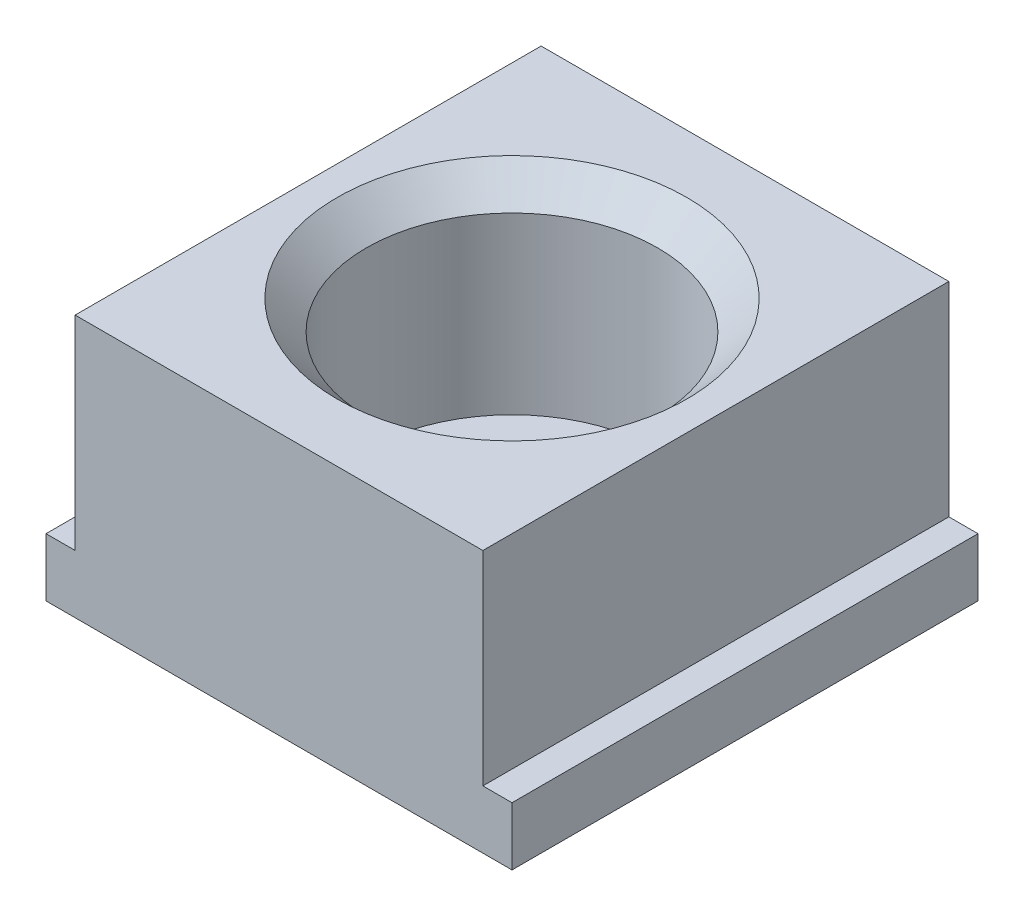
from build123d import *

# Parameters (mm, degrees)
BASE_EXTRUSION_DEPTH                            = 8
CHAMBRAGE_POUR_VIS_T_TE_CYLINDRIQUE_D           = 6.6
CHAMBRAGE_POUR_VIS_T_TE_CYLINDRIQUE_DEPTH       = 11.5
CHAMBRAGE_POUR_VIS_T_TE_CYLINDRIQUE_CBORE_D     = 10
CHAMBRAGE_POUR_VIS_T_TE_CYLINDRIQUE_CBORE_DEPTH = 7
CHAMBRAGE_POUR_VIS_T_TE_CYLINDRIQUE_TIP         = 1.982840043
CHANFREIN2_SIZE                                 = 1


with BuildPart() as part:
    # Esquisse1 → Base-Extrusion (new, symmetric)
    with BuildSketch(Plane.XY):
        Polygon((0, 0), (16, 0), (16, 2), (15, 2), (15, 9), (1, 9), (1, 2), (0, 2), align=None)
    extrude(amount=BASE_EXTRUSION_DEPTH, both=True)

    # Chambrage pour vis _ t_te cylindrique
    with Locations(Plane(origin=(0, 9, 0), x_dir=(-1, 0, 0), z_dir=(0, 1, 0))):
        with Locations((-8, 0)):
            CounterBoreHole(CHAMBRAGE_POUR_VIS_T_TE_CYLINDRIQUE_D / 2, CHAMBRAGE_POUR_VIS_T_TE_CYLINDRIQUE_CBORE_D / 2, CHAMBRAGE_POUR_VIS_T_TE_CYLINDRIQUE_CBORE_DEPTH, depth=CHAMBRAGE_POUR_VIS_T_TE_CYLINDRIQUE_DEPTH)
            with Locations((0, 0, -(CHAMBRAGE_POUR_VIS_T_TE_CYLINDRIQUE_DEPTH + CHAMBRAGE_POUR_VIS_T_TE_CYLINDRIQUE_TIP / 2))):  # 118° drill point
                Cone(0, CHAMBRAGE_POUR_VIS_T_TE_CYLINDRIQUE_D / 2, CHAMBRAGE_POUR_VIS_T_TE_CYLINDRIQUE_TIP, mode=Mode.SUBTRACT)

    # Chanfrein2
    chanfrein2_edges = [part.edges().sort_by_distance(p)[0] for p in [
        (4.7, 0, 0),
        (13, 9, 0),
    ]]
    chamfer(chanfrein2_edges, length=CHANFREIN2_SIZE)


solid = part.part
